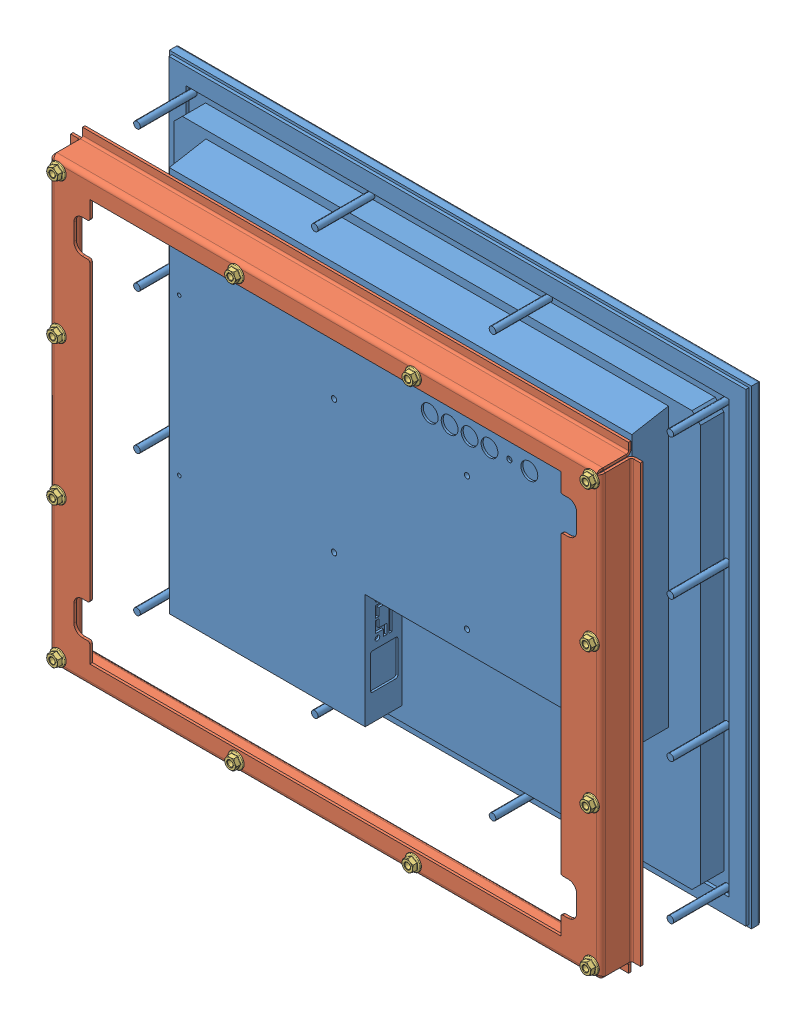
SolidWorks assembly 17 inch Panel Mount Monitor, HIS-ML17-xxxH.SLDASM, configuration Default (file format 10000). Lengths in mm.
Overall size (437.77 353.57 113.82).
14 component instances, 3 part files, 26 mates.
Components (placement in the parent):
- Monitor, 17H-1: Monitor, 17H.sldprt [Default] at (-159.1329 -466.8768 -14.4973) size (437.77 353.57 52.12)
- Collar, 10005-1: Collar, 10005.sldprt [Default] at (-366.5493 -632.9699 87.2088) size (428.69 345.89 24.63)
- M5 Nut, 30008-1: M5 Nut, 30008.sldprt [M5 Nut - 30008] at (-359.6024 -308.3808 92.2088) x (-0.383049 0.923728 0) z (0 0 1) size (11.8 11.8 5)
- M5 Nut, 30008-2: M5 Nut, 30008.sldprt [M5 Nut - 30008] at (-225.7444 -308.3808 92.2088) x (0 -1 0) z (0 0 1) size (11.8 11.8 5)
- M5 Nut, 30008-3: M5 Nut, 30008.sldprt [M5 Nut - 30008] at (-92.3944 -308.3808 92.2088) x (0 -1 0) z (0 0 1) size (11.8 11.8 5)
- M5 Nut, 30008-4: M5 Nut, 30008.sldprt [M5 Nut - 30008] at (41.4636 -308.3808 92.2088) x (0 -1 0) z (0 0 1) size (11.8 11.8 5)
- M5 Nut, 30008-5: M5 Nut, 30008.sldprt [M5 Nut - 30008] at (41.4636 -414.2988 92.2088) x (0 -1 0) z (0 0 1) size (11.8 11.8 5)
- M5 Nut, 30008-6: M5 Nut, 30008.sldprt [M5 Nut - 30008] at (41.4636 -519.4852 92.2088) x (0 -1 0) z (0 0 1) size (11.8 11.8 5)
- M5 Nut, 30008-7: M5 Nut, 30008.sldprt [M5 Nut - 30008] at (41.4636 -625.4032 92.2088) x (0.982823 -0.184551 0) z (0 0 1) size (11.8 11.8 5)
- M5 Nut, 30008-8: M5 Nut, 30008.sldprt [M5 Nut - 30008] at (-92.3944 -625.4032 92.2088) size (11.8 11.8 5)
- M5 Nut, 30008-9: M5 Nut, 30008.sldprt [M5 Nut - 30008] at (-225.7444 -625.4032 92.2088) x (0 1 0) z (0 0 1) size (11.8 11.8 5)
- M5 Nut, 30008-10: M5 Nut, 30008.sldprt [M5 Nut - 30008] at (-359.6024 -625.4032 92.2088) size (11.8 11.8 5)
- M5 Nut, 30008-11: M5 Nut, 30008.sldprt [M5 Nut - 30008] at (-359.6024 -519.4852 92.2088) size (11.8 11.8 5)
- M5 Nut, 30008-12: M5 Nut, 30008.sldprt [M5 Nut - 30008] at (-359.6024 -414.2988 92.2088) size (11.8 11.8 5)
Mates (geometry in assembly coordinates):
- Concentric1: concentric anti-aligned: cylinder of Monitor, 17H-1 through (41.4636 -308.3808 28.2027) axis (0 0 -1) radius 2.5; cylinder of Collar, 10005-1 through (41.4636 -308.3808 85.3114) axis (0 0 1) radius 3.1877
- Parallel1: parallel anti-aligned: line of Monitor, 17H-1 through (59.7516 -290.0928 -14.4973) axis (-1 0 0); line of Collar, 10005-1 through (-364.4752 -293.9485 64.4758) axis (1 0 0)
- Concentric21: concentric aligned: cylinder of Collar, 10005-1 through (-359.6024 -308.3808 85.3114) axis (0 0 1) radius 3.1877; cylinder of M5 Nut, 30008-1 through (-359.6024 -308.3808 67.1713) axis (0 0 1) radius 2.5
- Coincident11: coincident anti-aligned: plane of Collar, 10005-1 through (-366.5493 -632.9699 87.2088) normal (0 0 1); plane of M5 Nut, 30008-1 through (-363.8689 -310.15 87.2088) normal (0 0 -1)
- Concentric31: concentric aligned: cylinder of Collar, 10005-1 through (-225.7444 -308.3808 85.3114) axis (0 0 1) radius 3.1877; cylinder of M5 Nut, 30008-2 through (-225.7444 -308.3808 67.1713) axis (0 0 1) radius 2.5
- Coincident21: coincident anti-aligned: plane of Collar, 10005-1 through (-366.5493 -632.9699 87.2088) normal (0 0 1); plane of M5 Nut, 30008-2 through (-221.1256 -308.3808 87.2088) normal (0 0 -1)
- Concentric41: concentric aligned: cylinder of Collar, 10005-1 through (-92.3944 -308.3808 85.3114) axis (0 0 1) radius 3.1877; cylinder of M5 Nut, 30008-3 through (-92.3944 -308.3808 67.1713) axis (0 0 1) radius 2.5
- Coincident31: coincident anti-aligned: plane of Collar, 10005-1 through (-366.5493 -632.9699 87.2088) normal (0 0 1); plane of M5 Nut, 30008-3 through (-87.7756 -308.3808 87.2088) normal (0 0 -1)
- Concentric51: concentric aligned: cylinder of Collar, 10005-1 through (41.4636 -308.3808 85.3114) axis (0 0 1) radius 3.1877; cylinder of M5 Nut, 30008-4 through (41.4636 -308.3808 67.1713) axis (0 0 1) radius 2.5
- Coincident41: coincident anti-aligned: plane of Collar, 10005-1 through (-366.5493 -632.9699 87.2088) normal (0 0 1); plane of M5 Nut, 30008-4 through (46.0824 -308.3808 87.2088) normal (0 0 -1)
- Concentric61: concentric aligned: cylinder of Collar, 10005-1 through (41.4636 -414.2988 85.3114) axis (0 0 1) radius 3.1877; cylinder of M5 Nut, 30008-5 through (41.4636 -414.2988 67.1713) axis (0 0 1) radius 2.5
- Coincident51: coincident anti-aligned: plane of Collar, 10005-1 through (-366.5493 -632.9699 87.2088) normal (0 0 1); plane of M5 Nut, 30008-5 through (46.0824 -414.2988 87.2088) normal (0 0 -1)
- Concentric71: concentric aligned: cylinder of Collar, 10005-1 through (41.4636 -519.4852 85.3114) axis (0 0 1) radius 3.1877; cylinder of M5 Nut, 30008-6 through (41.4636 -519.4852 67.1713) axis (0 0 1) radius 2.5
- Coincident61: coincident anti-aligned: plane of Collar, 10005-1 through (-366.5493 -632.9699 87.2088) normal (0 0 1); plane of M5 Nut, 30008-6 through (46.0824 -519.4852 87.2088) normal (0 0 -1)
- Concentric81: concentric aligned: cylinder of Collar, 10005-1 through (41.4636 -625.4032 85.3114) axis (0 0 1) radius 3.1877; cylinder of M5 Nut, 30008-7 through (41.4636 -625.4032 67.1713) axis (0 0 1) radius 2.5
- Coincident71: coincident anti-aligned: plane of Collar, 10005-1 through (-366.5493 -632.9699 87.2088) normal (0 0 1); plane of M5 Nut, 30008-7 through (42.316 -620.8638 87.2088) normal (0 0 -1)
- Concentric91: concentric aligned: cylinder of Collar, 10005-1 through (-92.3944 -625.4032 85.3114) axis (0 0 1) radius 3.1877; cylinder of M5 Nut, 30008-8 through (-92.3944 -625.4032 67.1713) axis (0 0 1) radius 2.5
- Coincident81: coincident anti-aligned: plane of Collar, 10005-1 through (-366.5493 -632.9699 87.2088) normal (0 0 1); plane of M5 Nut, 30008-8 through (-92.3944 -620.7844 87.2088) normal (0 0 -1)
- Concentric101: concentric aligned: cylinder of Collar, 10005-1 through (-225.7444 -625.4032 85.3114) axis (0 0 1) radius 3.1877; cylinder of M5 Nut, 30008-9 through (-225.7444 -625.4032 67.1713) axis (0 0 1) radius 2.5
- Coincident91: coincident anti-aligned: plane of Collar, 10005-1 through (-366.5493 -632.9699 87.2088) normal (0 0 1); plane of M5 Nut, 30008-9 through (-230.3632 -625.4032 87.2088) normal (0 0 -1)
- Concentric111: concentric aligned: cylinder of Collar, 10005-1 through (-359.6024 -625.4032 85.3114) axis (0 0 1) radius 3.1877; cylinder of M5 Nut, 30008-10 through (-359.6024 -625.4032 67.1713) axis (0 0 1) radius 2.5
- Coincident101: coincident anti-aligned: plane of Collar, 10005-1 through (-366.5493 -632.9699 87.2088) normal (0 0 1); plane of M5 Nut, 30008-10 through (-359.6024 -620.7844 87.2088) normal (0 0 -1)
- Concentric121: concentric aligned: cylinder of Collar, 10005-1 through (-359.6024 -519.4852 85.3114) axis (0 0 1) radius 3.1877; cylinder of M5 Nut, 30008-11 through (-359.6024 -519.4852 67.1713) axis (0 0 1) radius 2.5
- Coincident111: coincident anti-aligned: plane of Collar, 10005-1 through (-366.5493 -632.9699 87.2088) normal (0 0 1); plane of M5 Nut, 30008-11 through (-359.6024 -514.8664 87.2088) normal (0 0 -1)
- Concentric131: concentric aligned: cylinder of Collar, 10005-1 through (-359.6024 -414.2988 85.3114) axis (0 0 1) radius 3.1877; cylinder of M5 Nut, 30008-12 through (-359.6024 -414.2988 67.1713) axis (0 0 1) radius 2.5
- Coincident121: coincident anti-aligned: plane of Collar, 10005-1 through (-366.5493 -632.9699 87.2088) normal (0 0 1); plane of M5 Nut, 30008-12 through (-359.6024 -409.68 87.2088) normal (0 0 -1)
